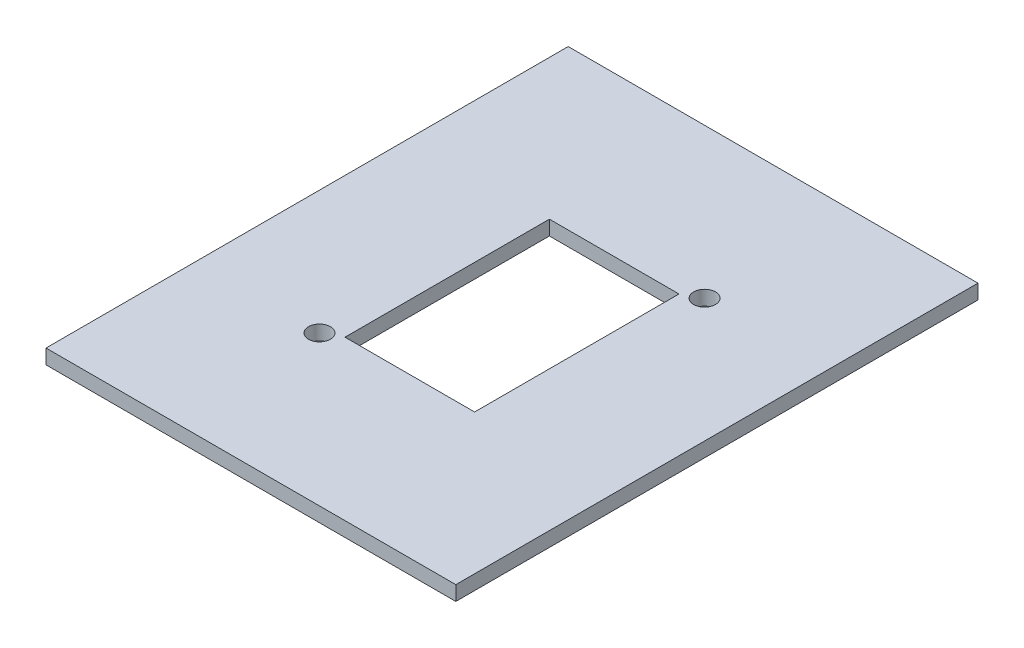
from build123d import *

# Parameters (mm, degrees)
SKETCH1_W           = 56.13529043
SKETCH1_H           = 71.529878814
SKETCH1_R           = 1.5
SKETCH1_W_2         = 17.75
SKETCH1_H_2         = 28
BOSS_EXTRUDE1_DEPTH = 2


with BuildPart() as part:
    # Sketch1 → Boss-Extrude1 (new body)
    with BuildSketch(Plane(origin=(0, 0, 0), x_dir=(1, 0, 0), z_dir=(0, 1, 0))):
        Rectangle(SKETCH1_W, SKETCH1_H)
        with Locations(Location((11.125, 15.25, 0), (0, 0, 270))):
            Circle(SKETCH1_R, mode=Mode.SUBTRACT)
        with Locations(Location((-11.125, -15.25, 0), (0, 0, 270))):
            Circle(SKETCH1_R, mode=Mode.SUBTRACT)
        Rectangle(SKETCH1_W_2, SKETCH1_H_2, mode=Mode.SUBTRACT)
    extrude(amount=BOSS_EXTRUDE1_DEPTH)


solid = part.part
